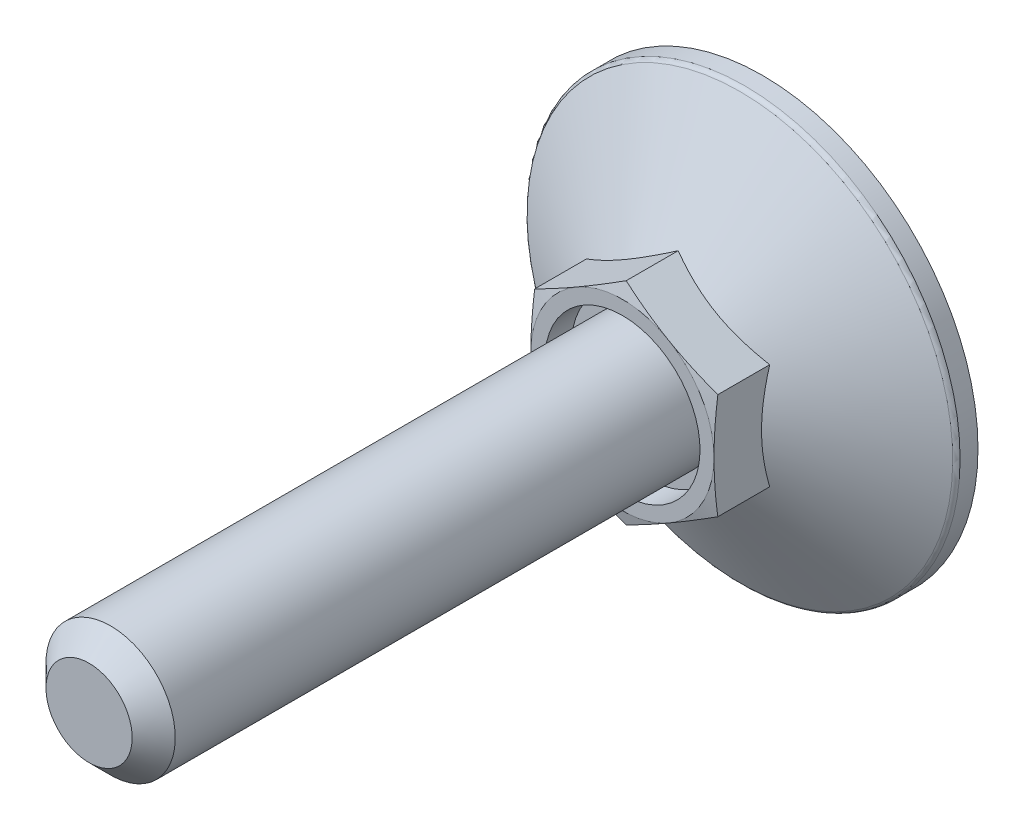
ISO-10303-21;
HEADER;
FILE_DESCRIPTION(('STEP AP214'),'2;1');
FILE_NAME('part.step','',(''),(''),'','','');
FILE_SCHEMA(('AUTOMOTIVE_DESIGN { 1 0 10303 214 1 1 1 1 }'));
ENDSEC;
DATA;
#1=APPLICATION_CONTEXT('core data for automotive mechanical design processes');
#2=APPLICATION_PROTOCOL_DEFINITION('international standard','automotive_design',2000,#1);
#3=PRODUCT_CONTEXT('',#1,'mechanical');
#4=PRODUCT('Part','Part','',(#3));
#5=PRODUCT_RELATED_PRODUCT_CATEGORY('part','',(#4));
#6=PRODUCT_DEFINITION_FORMATION('','',#4);
#7=PRODUCT_DEFINITION_CONTEXT('part definition',#1,'design');
#8=PRODUCT_DEFINITION('design','',#6,#7);
#9=PRODUCT_DEFINITION_SHAPE('','',#8);
#10=(LENGTH_UNIT() NAMED_UNIT(*) SI_UNIT(.MILLI.,.METRE.));
#11=(NAMED_UNIT(*) PLANE_ANGLE_UNIT() SI_UNIT($,.RADIAN.));
#12=(NAMED_UNIT(*) SI_UNIT($,.STERADIAN.) SOLID_ANGLE_UNIT());
#13=UNCERTAINTY_MEASURE_WITH_UNIT(LENGTH_MEASURE(1.E-05),#10,'distance_accuracy_value','');
#14=(GEOMETRIC_REPRESENTATION_CONTEXT(3) GLOBAL_UNCERTAINTY_ASSIGNED_CONTEXT((#13)) GLOBAL_UNIT_ASSIGNED_CONTEXT((#10,
#11,#12)) REPRESENTATION_CONTEXT('',''));
#15=CARTESIAN_POINT('',(0.,0.,0.));
#16=DIRECTION('',(0.,0.,1.));
#17=DIRECTION('',(1.,0.,0.));
#18=AXIS2_PLACEMENT_3D('',#15,#16,#17);
#19=CARTESIAN_POINT('',(0.,0.,10.525));
#20=DIRECTION('',(0.,0.,-1.));
#21=DIRECTION('',(0.,1.,0.));
#22=AXIS2_PLACEMENT_3D('',#19,#20,#21);
#23=PLANE('',#22);
#24=CARTESIAN_POINT('',(0.,0.,10.525));
#25=DIRECTION('',(0.,0.,-1.));
#26=DIRECTION('',(0.,1.,0.));
#27=AXIS2_PLACEMENT_3D('',#24,#25,#26);
#28=CIRCLE('',#27,7.2);
#29=CARTESIAN_POINT('',(0.,7.2,10.525));
#30=VERTEX_POINT('',#29);
#31=EDGE_CURVE('E108',#30,#30,#28,.T.);
#32=ORIENTED_EDGE('',*,*,#31,.F.);
#33=EDGE_LOOP('',(#32));
#34=FACE_BOUND('',#33,.T.);
#35=CARTESIAN_POINT('',(0.,0.,10.525));
#36=DIRECTION('',(0.,0.,-1.));
#37=DIRECTION('',(0.,1.,0.));
#38=AXIS2_PLACEMENT_3D('',#35,#36,#37);
#39=CIRCLE('',#38,6.);
#40=CARTESIAN_POINT('',(0.,6.,10.525));
#41=VERTEX_POINT('',#40);
#42=EDGE_CURVE('E260',#41,#41,#39,.F.);
#43=ORIENTED_EDGE('',*,*,#42,.F.);
#44=EDGE_LOOP('',(#43));
#45=FACE_BOUND('',#44,.T.);
#46=ADVANCED_FACE('F14',(#34,#45),#23,.F.);
#47=CARTESIAN_POINT('',(0.,9.81495457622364,99.));
#48=DIRECTION('',(0.5,-0.866025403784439,0.));
#49=DIRECTION('',(0.866025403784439,0.5,0.));
#50=AXIS2_PLACEMENT_3D('',#47,#48,#49);
#51=PLANE('',#50);
#52=CARTESIAN_POINT('',(-8.5002,4.90736181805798,7.83027204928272));
#53=CARTESIAN_POINT('',(-8.31336077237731,5.01523349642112,7.89254195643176));
#54=CARTESIAN_POINT('',(-8.1258249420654,5.1235073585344,7.95198579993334));
#55=CARTESIAN_POINT('',(-7.74923024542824,5.34093440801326,8.06444298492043));
#56=CARTESIAN_POINT('',(-7.56017075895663,5.45008795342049,8.1174535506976));
#57=CARTESIAN_POINT('',(-6.9899652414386,5.77929626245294,8.26579470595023));
#58=CARTESIAN_POINT('',(-6.60656835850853,6.00065055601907,8.3501691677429));
#59=CARTESIAN_POINT('',(-6.03282233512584,6.33190297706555,8.44910807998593));
#60=CARTESIAN_POINT('',(-5.84418723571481,6.44081150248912,8.47729289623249));
#61=CARTESIAN_POINT('',(-5.46606397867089,6.65912106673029,8.52455401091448));
#62=CARTESIAN_POINT('',(-5.27657589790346,6.76852206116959,8.54363111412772));
#63=CARTESIAN_POINT('',(-4.8972734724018,6.98751241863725,8.57219332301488));
#64=CARTESIAN_POINT('',(-4.7074597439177,7.09710142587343,8.58168931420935));
#65=CARTESIAN_POINT('',(-4.32765694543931,7.3163806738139,8.59088571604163));
#66=CARTESIAN_POINT('',(-4.13766788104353,7.42607091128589,8.59058642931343));
#67=CARTESIAN_POINT('',(-3.78247698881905,7.63114046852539,8.58087362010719));
#68=CARTESIAN_POINT('',(-3.6172500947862,7.72653426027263,8.57264492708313));
#69=CARTESIAN_POINT('',(-3.28718328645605,7.9170984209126,8.54893885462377));
#70=CARTESIAN_POINT('',(-3.12234339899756,8.01226877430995,8.53346098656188));
#71=CARTESIAN_POINT('',(-2.62846189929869,8.29741139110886,8.47651947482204));
#72=CARTESIAN_POINT('',(-2.30029449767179,8.48687892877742,8.42455503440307));
#73=CARTESIAN_POINT('',(-1.64047857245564,8.86782383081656,8.29464315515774));
#74=CARTESIAN_POINT('',(-1.30891425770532,9.05925257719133,8.21614502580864));
#75=CARTESIAN_POINT('',(-0.650730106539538,9.43925537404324,8.03798675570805));
#76=CARTESIAN_POINT('',(-0.324101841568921,9.62783429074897,7.93836845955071));
#77=CARTESIAN_POINT('',(0.000199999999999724,9.81507004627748,7.83027204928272));
#78=B_SPLINE_CURVE_WITH_KNOTS('',3,(#52,#53,#54,#55,#56,#57,#58,#59,#60,#61,#62,#63,#64,#65,#66,
#67,#68,#69,#70,#71,#72,#73,#74,#75,#76,#77),.UNSPECIFIED.,.F.,.F.,(4,2,2,2,2,2,2,2,2,2,2,2,4),
(0.,0.673596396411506,1.34748239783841,2.69805431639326,3.356799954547,4.01548737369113,
4.67342558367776,5.33134346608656,5.90409556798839,6.47688628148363,7.62328361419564,
8.79510569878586,9.9646274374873),.UNSPECIFIED.);
#79=CARTESIAN_POINT('',(-8.5,4.90747728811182,7.83033871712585));
#80=VERTEX_POINT('',#79);
#81=CARTESIAN_POINT('',(0.,9.81495457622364,7.83033871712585));
#82=VERTEX_POINT('',#81);
#83=EDGE_CURVE('E97',#80,#82,#78,.T.);
#84=ORIENTED_EDGE('',*,*,#83,.F.);
#85=DIRECTION('',(0.,0.,-1.));
#86=VECTOR('',#85,1.);
#87=CARTESIAN_POINT('',(-8.5,4.90747728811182,99.));
#88=LINE('',#87,#86);
#89=CARTESIAN_POINT('',(-8.5,4.90747728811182,12.6476589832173));
#90=VERTEX_POINT('',#89);
#91=EDGE_CURVE('E86',#90,#80,#88,.T.);
#92=ORIENTED_EDGE('',*,*,#91,.F.);
#93=CARTESIAN_POINT('',(0.000200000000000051,9.81507004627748,12.6476280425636));
#94=CARTESIAN_POINT('',(-0.352800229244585,9.61126526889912,12.7022599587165));
#95=CARTESIAN_POINT('',(-0.706440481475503,9.40709097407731,12.7518566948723));
#96=CARTESIAN_POINT('',(-1.41496987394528,8.99802133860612,12.8389934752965));
#97=CARTESIAN_POINT('',(-1.76985946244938,8.79312573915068,12.8765286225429));
#98=CARTESIAN_POINT('',(-2.47873586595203,8.38385575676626,12.9373509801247));
#99=CARTESIAN_POINT('',(-2.83271788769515,8.17948414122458,12.9607107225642));
#100=CARTESIAN_POINT('',(-3.5411333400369,7.77048028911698,12.9920337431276));
#101=CARTESIAN_POINT('',(-3.89556667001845,7.56584811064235,13.));
#102=CARTESIAN_POINT('',(-4.60443332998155,7.15658375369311,13.));
#103=CARTESIAN_POINT('',(-4.9588666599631,6.95195157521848,12.9920337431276));
#104=CARTESIAN_POINT('',(-5.66728211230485,6.54294772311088,12.9607107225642));
#105=CARTESIAN_POINT('',(-6.02126413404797,6.33857610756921,12.9373509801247));
#106=CARTESIAN_POINT('',(-6.73014053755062,5.92930612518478,12.8765286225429));
#107=CARTESIAN_POINT('',(-7.08503012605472,5.72441052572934,12.8389934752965));
#108=CARTESIAN_POINT('',(-7.7935595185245,5.31534089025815,12.7518566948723));
#109=CARTESIAN_POINT('',(-8.14719977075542,5.11116659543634,12.7022599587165));
#110=CARTESIAN_POINT('',(-8.5002,4.90736181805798,12.6476280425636));
#111=B_SPLINE_CURVE_WITH_KNOTS('',3,(#93,#94,#95,#96,#97,#98,#99,#100,#101,#102,#103,#104,#105,
#106,#107,#108,#109,#110),.UNSPECIFIED.,.F.,.F.,(4,2,2,2,2,2,2,2,4),(0.,1.23382789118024,
2.46815608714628,3.69611406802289,4.92383440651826,6.15155474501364,7.37951272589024,
8.61384092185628,9.84766881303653),.UNSPECIFIED.);
#112=CARTESIAN_POINT('',(-4.25,7.36121593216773,13.));
#113=VERTEX_POINT('',#112);
#114=EDGE_CURVE('E187',#113,#90,#111,.T.);
#115=ORIENTED_EDGE('',*,*,#114,.F.);
#116=CARTESIAN_POINT('',(0.,9.81495457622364,12.6476589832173));
#117=VERTEX_POINT('',#116);
#118=EDGE_CURVE('E319',#117,#113,#111,.T.);
#119=ORIENTED_EDGE('',*,*,#118,.F.);
#120=DIRECTION('',(0.,0.,-1.));
#121=VECTOR('',#120,1.);
#122=CARTESIAN_POINT('',(0.,9.81495457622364,99.));
#123=LINE('',#122,#121);
#124=EDGE_CURVE('E101',#117,#82,#123,.T.);
#125=ORIENTED_EDGE('',*,*,#124,.T.);
#126=EDGE_LOOP('',(#84,#92,#115,#119,#125));
#127=FACE_BOUND('',#126,.T.);
#128=ADVANCED_FACE('F100',(#127),#51,.F.);
#129=CARTESIAN_POINT('',(8.5,4.90747728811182,99.));
#130=DIRECTION('',(-0.5,-0.866025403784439,0.));
#131=DIRECTION('',(0.866025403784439,-0.5,0.));
#132=AXIS2_PLACEMENT_3D('',#129,#130,#131);
#133=PLANE('',#132);
#134=CARTESIAN_POINT('',(-0.0002,9.81507004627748,7.83027204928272));
#135=CARTESIAN_POINT('',(0.186639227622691,9.70719836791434,7.89254195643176));
#136=CARTESIAN_POINT('',(0.374175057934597,9.59892450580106,7.95198579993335));
#137=CARTESIAN_POINT('',(0.750769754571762,9.3814974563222,8.06444298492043));
#138=CARTESIAN_POINT('',(0.939829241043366,9.27234391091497,8.1174535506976));
#139=CARTESIAN_POINT('',(1.5100347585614,8.94313560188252,8.26579470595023));
#140=CARTESIAN_POINT('',(1.89343164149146,8.72178130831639,8.3501691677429));
#141=CARTESIAN_POINT('',(2.46717766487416,8.39052888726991,8.44910807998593));
#142=CARTESIAN_POINT('',(2.65581276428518,8.28162036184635,8.47729289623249));
#143=CARTESIAN_POINT('',(3.03393602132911,8.06331079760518,8.52455401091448));
#144=CARTESIAN_POINT('',(3.22342410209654,7.95390980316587,8.54363111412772));
#145=CARTESIAN_POINT('',(3.6027265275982,7.73491944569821,8.57219332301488));
#146=CARTESIAN_POINT('',(3.79254025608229,7.62533043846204,8.58168931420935));
#147=CARTESIAN_POINT('',(4.17234305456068,7.40605119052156,8.59088571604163));
#148=CARTESIAN_POINT('',(4.36233211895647,7.29636095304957,8.59058642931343));
#149=CARTESIAN_POINT('',(4.71752301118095,7.09129139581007,8.58087362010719));
#150=CARTESIAN_POINT('',(4.8827499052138,6.99589760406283,8.57264492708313));
#151=CARTESIAN_POINT('',(5.21281671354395,6.80533344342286,8.54893885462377));
#152=CARTESIAN_POINT('',(5.37765660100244,6.71016309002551,8.53346098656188));
#153=CARTESIAN_POINT('',(5.87153810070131,6.42502047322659,8.47651947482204));
#154=CARTESIAN_POINT('',(6.19970550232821,6.23555293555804,8.42455503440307));
#155=CARTESIAN_POINT('',(6.85952142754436,5.8546080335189,8.29464315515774));
#156=CARTESIAN_POINT('',(7.19108574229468,5.66317928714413,8.21614502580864));
#157=CARTESIAN_POINT('',(7.84926989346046,5.28317649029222,8.03798675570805));
#158=CARTESIAN_POINT('',(8.17589815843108,5.09459757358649,7.93836845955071));
#159=CARTESIAN_POINT('',(8.5002,4.90736181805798,7.83027204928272));
#160=B_SPLINE_CURVE_WITH_KNOTS('',3,(#134,#135,#136,#137,#138,#139,#140,#141,#142,#143,#144,
#145,#146,#147,#148,#149,#150,#151,#152,#153,#154,#155,#156,#157,#158,#159),.UNSPECIFIED.,.F.,
.F.,(4,2,2,2,2,2,2,2,2,2,2,2,4),(0.,0.673596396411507,1.34748239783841,2.69805431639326,
3.35679995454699,4.01548737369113,4.67342558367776,5.33134346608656,5.90409556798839,
6.47688628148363,7.62328361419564,8.79510569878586,9.9646274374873),.UNSPECIFIED.);
#161=CARTESIAN_POINT('',(8.5,4.90747728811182,7.83033871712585));
#162=VERTEX_POINT('',#161);
#163=EDGE_CURVE('E29',#82,#162,#160,.T.);
#164=ORIENTED_EDGE('',*,*,#163,.F.);
#165=ORIENTED_EDGE('',*,*,#124,.F.);
#166=CARTESIAN_POINT('',(8.5002,4.90736181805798,12.6476280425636));
#167=CARTESIAN_POINT('',(8.14719977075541,5.11116659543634,12.7022599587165));
#168=CARTESIAN_POINT('',(7.7935595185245,5.31534089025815,12.7518566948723));
#169=CARTESIAN_POINT('',(7.08503012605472,5.72441052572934,12.8389934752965));
#170=CARTESIAN_POINT('',(6.73014053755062,5.92930612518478,12.8765286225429));
#171=CARTESIAN_POINT('',(6.02126413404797,6.33857610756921,12.9373509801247));
#172=CARTESIAN_POINT('',(5.66728211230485,6.54294772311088,12.9607107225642));
#173=CARTESIAN_POINT('',(4.9588666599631,6.95195157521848,12.9920337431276));
#174=CARTESIAN_POINT('',(4.60443332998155,7.15658375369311,13.));
#175=CARTESIAN_POINT('',(3.89556667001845,7.56584811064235,13.));
#176=CARTESIAN_POINT('',(3.5411333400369,7.77048028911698,12.9920337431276));
#177=CARTESIAN_POINT('',(2.83271788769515,8.17948414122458,12.9607107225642));
#178=CARTESIAN_POINT('',(2.47873586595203,8.38385575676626,12.9373509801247));
#179=CARTESIAN_POINT('',(1.76985946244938,8.79312573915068,12.8765286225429));
#180=CARTESIAN_POINT('',(1.41496987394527,8.99802133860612,12.8389934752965));
#181=CARTESIAN_POINT('',(0.7064404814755,9.40709097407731,12.7518566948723));
#182=CARTESIAN_POINT('',(0.352800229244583,9.61126526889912,12.7022599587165));
#183=CARTESIAN_POINT('',(-0.000200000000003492,9.81507004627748,12.6476280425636));
#184=B_SPLINE_CURVE_WITH_KNOTS('',3,(#166,#167,#168,#169,#170,#171,#172,#173,#174,#175,#176,
#177,#178,#179,#180,#181,#182,#183),.UNSPECIFIED.,.F.,.F.,(4,2,2,2,2,2,2,2,4),(0.,
1.23382789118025,2.46815608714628,3.69611406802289,4.92383440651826,6.15155474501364,
7.37951272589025,8.61384092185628,9.84766881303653),.UNSPECIFIED.);
#185=CARTESIAN_POINT('',(4.25,7.36121593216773,13.));
#186=VERTEX_POINT('',#185);
#187=EDGE_CURVE('E178',#186,#117,#184,.T.);
#188=ORIENTED_EDGE('',*,*,#187,.F.);
#189=CARTESIAN_POINT('',(8.5,4.90747728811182,12.6476589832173));
#190=VERTEX_POINT('',#189);
#191=EDGE_CURVE('E185',#190,#186,#184,.T.);
#192=ORIENTED_EDGE('',*,*,#191,.F.);
#193=DIRECTION('',(0.,0.,-1.));
#194=VECTOR('',#193,1.);
#195=CARTESIAN_POINT('',(8.5,4.90747728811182,99.));
#196=LINE('',#195,#194);
#197=EDGE_CURVE('E217',#190,#162,#196,.T.);
#198=ORIENTED_EDGE('',*,*,#197,.T.);
#199=EDGE_LOOP('',(#164,#165,#188,#192,#198));
#200=FACE_BOUND('',#199,.T.);
#201=ADVANCED_FACE('F193',(#200),#133,.F.);
#202=CARTESIAN_POINT('',(8.5,-4.90747728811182,99.));
#203=DIRECTION('',(-1.,0.,0.));
#204=DIRECTION('',(0.,-1.,0.));
#205=AXIS2_PLACEMENT_3D('',#202,#203,#204);
#206=PLANE('',#205);
#207=CARTESIAN_POINT('',(8.5,12.8220542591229,4.61528116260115));
#208=CARTESIAN_POINT('',(8.5,12.4534155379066,4.79262377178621));
#209=CARTESIAN_POINT('',(8.5,12.0838902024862,4.96815716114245));
#210=CARTESIAN_POINT('',(8.5,11.3425927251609,5.31457894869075));
#211=CARTESIAN_POINT('',(8.5,10.9708202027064,5.48546653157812));
#212=CARTESIAN_POINT('',(8.5,10.2224625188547,5.82250763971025));
#213=CARTESIAN_POINT('',(8.5,9.84586188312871,5.98862693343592));
#214=CARTESIAN_POINT('',(8.5,9.08953299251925,6.31355867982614));
#215=CARTESIAN_POINT('',(8.5,8.70980489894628,6.47237150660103));
#216=CARTESIAN_POINT('',(8.5,7.93635853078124,6.78489169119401));
#217=CARTESIAN_POINT('',(8.5,7.5425381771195,6.93834789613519));
#218=CARTESIAN_POINT('',(8.5,6.75016193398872,7.23275009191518));
#219=CARTESIAN_POINT('',(8.5,6.35160550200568,7.37369463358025));
#220=CARTESIAN_POINT('',(8.5,5.54998630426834,7.63911020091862));
#221=CARTESIAN_POINT('',(8.5,5.14693580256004,7.76361784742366));
#222=CARTESIAN_POINT('',(8.5,4.33508769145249,7.99193558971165));
#223=CARTESIAN_POINT('',(8.5,3.92629204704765,8.09575258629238));
#224=CARTESIAN_POINT('',(8.5,3.10458766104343,8.27700176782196));
#225=CARTESIAN_POINT('',(8.5,2.69170444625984,8.35454642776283));
#226=CARTESIAN_POINT('',(8.5,2.06892742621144,8.44757828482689));
#227=CARTESIAN_POINT('',(8.5,1.86074253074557,8.47470931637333));
#228=CARTESIAN_POINT('',(8.5,1.44346514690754,8.52067173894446));
#229=CARTESIAN_POINT('',(8.5,1.23437274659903,8.5395039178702));
#230=CARTESIAN_POINT('',(8.5,0.818123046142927,8.5682751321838));
#231=CARTESIAN_POINT('',(8.5,0.6109730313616,8.57831925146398));
#232=CARTESIAN_POINT('',(8.5,0.196434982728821,8.58967320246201));
#233=CARTESIAN_POINT('',(8.5,-0.0109530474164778,8.59098316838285));
#234=CARTESIAN_POINT('',(8.5,-0.425608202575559,8.58483724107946));
#235=CARTESIAN_POINT('',(8.5,-0.632875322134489,8.57738097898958));
#236=CARTESIAN_POINT('',(8.5,-1.04692490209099,8.55387613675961));
#237=CARTESIAN_POINT('',(8.5,-1.25370733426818,8.5378270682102));
#238=CARTESIAN_POINT('',(8.5,-1.76172684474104,8.48816674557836));
#239=CARTESIAN_POINT('',(8.5,-2.06251418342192,8.44986872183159));
#240=CARTESIAN_POINT('',(8.5,-2.66160170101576,8.35726697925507));
#241=CARTESIAN_POINT('',(8.5,-2.95990148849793,8.30296078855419));
#242=CARTESIAN_POINT('',(8.5,-3.85084347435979,8.11893322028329));
#243=CARTESIAN_POINT('',(8.5,-4.4391769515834,7.96814146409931));
#244=CARTESIAN_POINT('',(8.5,-5.31919968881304,7.70971639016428));
#245=CARTESIAN_POINT('',(8.5,-5.61551051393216,7.61694416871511));
#246=CARTESIAN_POINT('',(8.5,-6.20524874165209,7.4225646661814));
#247=CARTESIAN_POINT('',(8.5,-6.4986761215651,7.3209573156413));
#248=CARTESIAN_POINT('',(8.5,-7.08276471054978,7.11046965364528));
#249=CARTESIAN_POINT('',(8.5,-7.37342689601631,7.0015920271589));
#250=CARTESIAN_POINT('',(8.5,-7.95239195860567,6.77777126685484));
#251=CARTESIAN_POINT('',(8.5,-8.2406948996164,6.66282829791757));
#252=CARTESIAN_POINT('',(8.5,-8.80562449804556,6.43181846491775));
#253=CARTESIAN_POINT('',(8.5,-9.08231928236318,6.31591764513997));
#254=CARTESIAN_POINT('',(8.5,-9.63401072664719,6.0801365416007));
#255=CARTESIAN_POINT('',(8.5,-9.90900735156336,5.96025617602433));
#256=CARTESIAN_POINT('',(8.5,-10.7318217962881,5.59557173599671));
#257=CARTESIAN_POINT('',(8.5,-11.2774137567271,5.34574521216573));
#258=CARTESIAN_POINT('',(8.5,-12.3642460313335,4.83628492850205));
#259=CARTESIAN_POINT('',(8.5,-12.905484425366,4.57664710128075));
#260=CARTESIAN_POINT('',(8.5,-13.9843891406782,4.05013469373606));
#261=CARTESIAN_POINT('',(8.5,-14.5220556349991,3.78326046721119));
#262=CARTESIAN_POINT('',(8.5,-15.5954930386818,3.24355438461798));
#263=CARTESIAN_POINT('',(8.5,-16.1312593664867,2.97071343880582));
#264=CARTESIAN_POINT('',(8.5,-17.2005865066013,2.4207361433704));
#265=CARTESIAN_POINT('',(8.5,-17.7341472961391,2.14359974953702));
#266=CARTESIAN_POINT('',(8.5,-18.7993643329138,1.58600707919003));
#267=CARTESIAN_POINT('',(8.5,-19.3310210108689,1.30555162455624));
#268=CARTESIAN_POINT('',(8.5,-20.3928917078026,0.741921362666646));
#269=CARTESIAN_POINT('',(8.5,-20.9231057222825,0.458746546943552));
#270=CARTESIAN_POINT('',(8.5,-22.3874236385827,-0.32722037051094));
#271=CARTESIAN_POINT('',(8.5,-23.3202800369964,-0.83233607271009));
#272=CARTESIAN_POINT('',(8.5,-25.1833983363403,-1.84747335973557));
#273=CARTESIAN_POINT('',(8.5,-26.1136600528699,-2.35749528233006));
#274=CARTESIAN_POINT('',(8.5,-27.9692131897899,-3.37950461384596));
#275=CARTESIAN_POINT('',(8.5,-28.8945109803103,-3.89148046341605));
#276=CARTESIAN_POINT('',(8.5,-30.2812847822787,-4.66146611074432));
#277=CARTESIAN_POINT('',(8.5,-30.7433285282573,-4.91845451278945));
#278=CARTESIAN_POINT('',(8.5,-31.6670795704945,-5.43303439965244));
#279=CARTESIAN_POINT('',(8.5,-32.1287868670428,-5.69062588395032));
#280=CARTESIAN_POINT('',(8.5,-32.5903473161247,-5.94848028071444));
#281=B_SPLINE_CURVE_WITH_KNOTS('',3,(#207,#208,#209,#210,#211,#212,#213,#214,#215,#216,#217,
#218,#219,#220,#221,#222,#223,#224,#225,#226,#227,#228,#229,#230,#231,#232,#233,#234,#235,#236,
#237,#238,#239,#240,#241,#242,#243,#244,#245,#246,#247,#248,#249,#250,#251,#252,#253,#254,#255,
#256,#257,#258,#259,#260,#261,#262,#263,#264,#265,#266,#267,#268,#269,#270,#271,#272,#273,#274,
#275,#276,#277,#278,#279,#280),.UNSPECIFIED.,.F.,.F.,(4,2,2,2,2,2,2,2,2,2,2,2,2,2,2,2,2,2,2,2,2,
2,2,2,2,2,2,2,2,2,2,2,2,2,2,2,4),(0.,1.22725127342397,2.45471654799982,3.68948778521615,
4.92419572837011,6.19201746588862,7.45998585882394,8.72507978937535,9.98975107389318,
11.2489376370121,11.878634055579,12.5082706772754,13.1302712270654,13.7522622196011,
14.3742793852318,14.9963319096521,15.9054589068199,16.814726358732,18.6343169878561,
19.5657329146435,20.4971561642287,21.4282373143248,22.3592931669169,23.259222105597,
24.1591695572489,25.9592281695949,27.7600413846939,29.5607667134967,31.3644583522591,
33.1681685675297,34.9714411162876,36.7747192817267,39.9571898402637,43.1398810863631,
46.3123590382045,47.8984694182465,49.4845784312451),.UNSPECIFIED.);
#282=CARTESIAN_POINT('',(8.5,-4.90747728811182,7.83033871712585));
#283=VERTEX_POINT('',#282);
#284=EDGE_CURVE('E37',#162,#283,#281,.T.);
#285=ORIENTED_EDGE('',*,*,#284,.F.);
#286=ORIENTED_EDGE('',*,*,#197,.F.);
#287=CARTESIAN_POINT('',(8.5,12.9820891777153,11.1197370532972));
#288=CARTESIAN_POINT('',(8.5,12.5964686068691,11.2061594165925));
#289=CARTESIAN_POINT('',(8.5,12.2106068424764,11.2915248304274));
#290=CARTESIAN_POINT('',(8.5,11.4382824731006,11.4595712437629));
#291=CARTESIAN_POINT('',(8.5,11.0518198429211,11.5422521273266));
#292=CARTESIAN_POINT('',(8.5,10.2778290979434,11.7044309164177));
#293=CARTESIAN_POINT('',(8.5,9.89030030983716,11.7839256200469));
#294=CARTESIAN_POINT('',(8.5,9.11443612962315,11.9388739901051));
#295=CARTESIAN_POINT('',(8.5,8.72610074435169,12.0143276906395));
#296=CARTESIAN_POINT('',(8.5,7.95158013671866,12.159650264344));
#297=CARTESIAN_POINT('',(8.5,7.56540239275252,12.2295587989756));
#298=CARTESIAN_POINT('',(8.5,6.79199352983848,12.3632725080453));
#299=CARTESIAN_POINT('',(8.5,6.40476243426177,12.4270778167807));
#300=CARTESIAN_POINT('',(8.5,5.62917169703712,12.54714843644));
#301=CARTESIAN_POINT('',(8.5,5.24081220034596,12.6034146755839));
#302=CARTESIAN_POINT('',(8.5,4.46285737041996,12.70674908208));
#303=CARTESIAN_POINT('',(8.5,4.07326203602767,12.7538172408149));
#304=CARTESIAN_POINT('',(8.5,3.28844017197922,12.8374226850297));
#305=CARTESIAN_POINT('',(8.5,2.89320002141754,12.8738340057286));
#306=CARTESIAN_POINT('',(8.5,2.10172608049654,12.9336139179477));
#307=CARTESIAN_POINT('',(8.5,1.70549231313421,12.9569828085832));
#308=CARTESIAN_POINT('',(8.5,0.912605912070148,12.9893148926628));
#309=CARTESIAN_POINT('',(8.5,0.515953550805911,12.9982846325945));
#310=CARTESIAN_POINT('',(8.5,-0.27740821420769,13.0012669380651));
#311=CARTESIAN_POINT('',(8.5,-0.674117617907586,12.9952795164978));
#312=CARTESIAN_POINT('',(8.5,-1.46847963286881,12.9686842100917));
#313=CARTESIAN_POINT('',(8.5,-1.86613043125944,12.9480232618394));
#314=CARTESIAN_POINT('',(8.5,-2.66049684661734,12.8932602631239));
#315=CARTESIAN_POINT('',(8.5,-3.05721244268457,12.8591579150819));
#316=CARTESIAN_POINT('',(8.5,-3.84970511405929,12.7792347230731));
#317=CARTESIAN_POINT('',(8.5,-4.24548140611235,12.7334062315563));
#318=CARTESIAN_POINT('',(8.5,-5.03576028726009,12.6319377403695));
#319=CARTESIAN_POINT('',(8.5,-5.43026287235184,12.5762977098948));
#320=CARTESIAN_POINT('',(8.5,-6.19195385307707,12.4609360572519));
#321=CARTESIAN_POINT('',(8.5,-6.55922094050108,12.4017287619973));
#322=CARTESIAN_POINT('',(8.5,-7.29278719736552,12.2775674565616));
#323=CARTESIAN_POINT('',(8.5,-7.65908634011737,12.2126132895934));
#324=CARTESIAN_POINT('',(8.5,-8.39085027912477,12.078008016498));
#325=CARTESIAN_POINT('',(8.5,-8.75631499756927,12.0083564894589));
#326=CARTESIAN_POINT('',(8.5,-9.48649515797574,11.8652200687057));
#327=CARTESIAN_POINT('',(8.5,-9.85121059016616,11.7917351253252));
#328=CARTESIAN_POINT('',(8.5,-10.5800753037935,11.6416087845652));
#329=CARTESIAN_POINT('',(8.5,-10.944224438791,11.5649666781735));
#330=CARTESIAN_POINT('',(8.5,-11.6719684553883,11.4090909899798));
#331=CARTESIAN_POINT('',(8.5,-12.0355633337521,11.3298573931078));
#332=CARTESIAN_POINT('',(8.5,-13.1255915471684,11.0889686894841));
#333=CARTESIAN_POINT('',(8.5,-13.8513178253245,10.9241153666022));
#334=CARTESIAN_POINT('',(8.5,-15.2942598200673,10.590109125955));
#335=CARTESIAN_POINT('',(8.5,-16.0114890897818,10.421014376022));
#336=CARTESIAN_POINT('',(8.5,-17.4449475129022,10.0785875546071));
#337=CARTESIAN_POINT('',(8.5,-18.1611766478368,9.9052554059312));
#338=CARTESIAN_POINT('',(8.5,-19.5919856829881,9.55567998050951));
#339=CARTESIAN_POINT('',(8.5,-20.306566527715,9.37944056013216));
#340=CARTESIAN_POINT('',(8.5,-21.7351057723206,9.02455520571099));
#341=CARTESIAN_POINT('',(8.5,-22.4490641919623,8.84590935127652));
#342=CARTESIAN_POINT('',(8.5,-23.1628057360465,8.66641079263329));
#343=B_SPLINE_CURVE_WITH_KNOTS('',3,(#287,#288,#289,#290,#291,#292,#293,#294,#295,#296,#297,
#298,#299,#300,#301,#302,#303,#304,#305,#306,#307,#308,#309,#310,#311,#312,#313,#314,#315,#316,
#317,#318,#319,#320,#321,#322,#323,#324,#325,#326,#327,#328,#329,#330,#331,#332,#333,#334,#335,
#336,#337,#338,#339,#340,#341,#342),.UNSPECIFIED.,.F.,.F.,(4,2,2,2,2,2,2,2,2,2,2,2,2,2,2,2,2,2,
2,2,2,2,2,2,2,2,2,4),(0.,1.18556310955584,2.37117735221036,3.5579546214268,4.74472187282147,
5.92204594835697,7.09934411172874,8.27649719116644,9.45365137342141,10.6442044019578,
11.8347301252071,13.0247144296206,14.2146977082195,15.4090063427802,16.6033414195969,
17.7984574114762,18.9935771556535,20.1095500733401,21.2255534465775,22.3416569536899,
23.4577749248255,24.5741449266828,25.6905214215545,27.9231231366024,30.1337863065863,
32.3444897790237,34.5524651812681,36.7603677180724),.UNSPECIFIED.);
#344=CARTESIAN_POINT('',(8.5,0.,13.));
#345=VERTEX_POINT('',#344);
#346=EDGE_CURVE('E171',#345,#190,#343,.F.);
#347=ORIENTED_EDGE('',*,*,#346,.F.);
#348=CARTESIAN_POINT('',(8.5,-4.90747728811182,12.6476589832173));
#349=VERTEX_POINT('',#348);
#350=EDGE_CURVE('E186',#349,#345,#343,.F.);
#351=ORIENTED_EDGE('',*,*,#350,.F.);
#352=DIRECTION('',(0.,0.,-1.));
#353=VECTOR('',#352,1.);
#354=CARTESIAN_POINT('',(8.5,-4.90747728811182,99.));
#355=LINE('',#354,#353);
#356=EDGE_CURVE('E219',#349,#283,#355,.T.);
#357=ORIENTED_EDGE('',*,*,#356,.T.);
#358=EDGE_LOOP('',(#285,#286,#347,#351,#357));
#359=FACE_BOUND('',#358,.T.);
#360=ADVANCED_FACE('F196',(#359),#206,.F.);
#361=CARTESIAN_POINT('',(0.,-9.81495457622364,99.));
#362=DIRECTION('',(-0.5,0.866025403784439,0.));
#363=DIRECTION('',(-0.866025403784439,-0.5,0.));
#364=AXIS2_PLACEMENT_3D('',#361,#362,#363);
#365=PLANE('',#364);
#366=CARTESIAN_POINT('',(8.5002,-4.90736181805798,7.83027204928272));
#367=CARTESIAN_POINT('',(8.31336077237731,-5.01523349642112,7.89254195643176));
#368=CARTESIAN_POINT('',(8.1258249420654,-5.1235073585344,7.95198579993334));
#369=CARTESIAN_POINT('',(7.74923024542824,-5.34093440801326,8.06444298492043));
#370=CARTESIAN_POINT('',(7.56017075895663,-5.45008795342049,8.1174535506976));
#371=CARTESIAN_POINT('',(6.9899652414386,-5.77929626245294,8.26579470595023));
#372=CARTESIAN_POINT('',(6.60656835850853,-6.00065055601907,8.3501691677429));
#373=CARTESIAN_POINT('',(6.03282233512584,-6.33190297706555,8.44910807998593));
#374=CARTESIAN_POINT('',(5.84418723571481,-6.44081150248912,8.47729289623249));
#375=CARTESIAN_POINT('',(5.46606397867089,-6.65912106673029,8.52455401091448));
#376=CARTESIAN_POINT('',(5.27657589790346,-6.76852206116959,8.54363111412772));
#377=CARTESIAN_POINT('',(4.8972734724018,-6.98751241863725,8.57219332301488));
#378=CARTESIAN_POINT('',(4.7074597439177,-7.09710142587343,8.58168931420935));
#379=CARTESIAN_POINT('',(4.32765694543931,-7.3163806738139,8.59088571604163));
#380=CARTESIAN_POINT('',(4.13766788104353,-7.42607091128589,8.59058642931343));
#381=CARTESIAN_POINT('',(3.78247698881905,-7.63114046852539,8.58087362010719));
#382=CARTESIAN_POINT('',(3.6172500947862,-7.72653426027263,8.57264492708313));
#383=CARTESIAN_POINT('',(3.28718328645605,-7.9170984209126,8.54893885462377));
#384=CARTESIAN_POINT('',(3.12234339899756,-8.01226877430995,8.53346098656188));
#385=CARTESIAN_POINT('',(2.62846189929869,-8.29741139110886,8.47651947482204));
#386=CARTESIAN_POINT('',(2.30029449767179,-8.48687892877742,8.42455503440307));
#387=CARTESIAN_POINT('',(1.64047857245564,-8.86782383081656,8.29464315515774));
#388=CARTESIAN_POINT('',(1.30891425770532,-9.05925257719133,8.21614502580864));
#389=CARTESIAN_POINT('',(0.650730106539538,-9.43925537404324,8.03798675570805));
#390=CARTESIAN_POINT('',(0.324101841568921,-9.62783429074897,7.93836845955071));
#391=CARTESIAN_POINT('',(-0.000199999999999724,-9.81507004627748,7.83027204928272));
#392=B_SPLINE_CURVE_WITH_KNOTS('',3,(#366,#367,#368,#369,#370,#371,#372,#373,#374,#375,#376,
#377,#378,#379,#380,#381,#382,#383,#384,#385,#386,#387,#388,#389,#390,#391),.UNSPECIFIED.,.F.,
.F.,(4,2,2,2,2,2,2,2,2,2,2,2,4),(0.,0.673596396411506,1.34748239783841,2.69805431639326,
3.356799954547,4.01548737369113,4.67342558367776,5.33134346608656,5.90409556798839,
6.47688628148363,7.62328361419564,8.79510569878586,9.9646274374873),.UNSPECIFIED.);
#393=CARTESIAN_POINT('',(0.,-9.81495457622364,7.83033871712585));
#394=VERTEX_POINT('',#393);
#395=EDGE_CURVE('E277',#283,#394,#392,.T.);
#396=ORIENTED_EDGE('',*,*,#395,.F.);
#397=ORIENTED_EDGE('',*,*,#356,.F.);
#398=CARTESIAN_POINT('',(-0.000200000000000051,-9.81507004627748,12.6476280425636));
#399=CARTESIAN_POINT('',(0.352800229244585,-9.61126526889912,12.7022599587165));
#400=CARTESIAN_POINT('',(0.706440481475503,-9.40709097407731,12.7518566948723));
#401=CARTESIAN_POINT('',(1.41496987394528,-8.99802133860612,12.8389934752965));
#402=CARTESIAN_POINT('',(1.76985946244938,-8.79312573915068,12.8765286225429));
#403=CARTESIAN_POINT('',(2.47873586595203,-8.38385575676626,12.9373509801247));
#404=CARTESIAN_POINT('',(2.83271788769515,-8.17948414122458,12.9607107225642));
#405=CARTESIAN_POINT('',(3.5411333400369,-7.77048028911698,12.9920337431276));
#406=CARTESIAN_POINT('',(3.89556667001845,-7.56584811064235,13.));
#407=CARTESIAN_POINT('',(4.60443332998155,-7.15658375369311,13.));
#408=CARTESIAN_POINT('',(4.9588666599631,-6.95195157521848,12.9920337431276));
#409=CARTESIAN_POINT('',(5.66728211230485,-6.54294772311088,12.9607107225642));
#410=CARTESIAN_POINT('',(6.02126413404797,-6.33857610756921,12.9373509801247));
#411=CARTESIAN_POINT('',(6.73014053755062,-5.92930612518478,12.8765286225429));
#412=CARTESIAN_POINT('',(7.08503012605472,-5.72441052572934,12.8389934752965));
#413=CARTESIAN_POINT('',(7.7935595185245,-5.31534089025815,12.7518566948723));
#414=CARTESIAN_POINT('',(8.14719977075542,-5.11116659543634,12.7022599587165));
#415=CARTESIAN_POINT('',(8.5002,-4.90736181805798,12.6476280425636));
#416=B_SPLINE_CURVE_WITH_KNOTS('',3,(#398,#399,#400,#401,#402,#403,#404,#405,#406,#407,#408,
#409,#410,#411,#412,#413,#414,#415),.UNSPECIFIED.,.F.,.F.,(4,2,2,2,2,2,2,2,4),(0.,
1.23382789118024,2.46815608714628,3.69611406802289,4.92383440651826,6.15155474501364,
7.37951272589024,8.61384092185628,9.84766881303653),.UNSPECIFIED.);
#417=CARTESIAN_POINT('',(4.25,-7.36121593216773,13.));
#418=VERTEX_POINT('',#417);
#419=EDGE_CURVE('E165',#418,#349,#416,.T.);
#420=ORIENTED_EDGE('',*,*,#419,.F.);
#421=CARTESIAN_POINT('',(0.,-9.81495457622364,12.6476589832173));
#422=VERTEX_POINT('',#421);
#423=EDGE_CURVE('E300',#422,#418,#416,.T.);
#424=ORIENTED_EDGE('',*,*,#423,.F.);
#425=DIRECTION('',(0.,0.,-1.));
#426=VECTOR('',#425,1.);
#427=CARTESIAN_POINT('',(0.,-9.81495457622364,99.));
#428=LINE('',#427,#426);
#429=EDGE_CURVE('E221',#422,#394,#428,.T.);
#430=ORIENTED_EDGE('',*,*,#429,.T.);
#431=EDGE_LOOP('',(#396,#397,#420,#424,#430));
#432=FACE_BOUND('',#431,.T.);
#433=ADVANCED_FACE('F282',(#432),#365,.F.);
#434=CARTESIAN_POINT('',(-8.5,-4.90747728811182,99.));
#435=DIRECTION('',(0.5,0.866025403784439,0.));
#436=DIRECTION('',(-0.866025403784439,0.5,0.));
#437=AXIS2_PLACEMENT_3D('',#434,#435,#436);
#438=PLANE('',#437);
#439=CARTESIAN_POINT('',(0.0002,-9.81507004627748,7.83027204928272));
#440=CARTESIAN_POINT('',(-0.186639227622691,-9.70719836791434,7.89254195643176));
#441=CARTESIAN_POINT('',(-0.374175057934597,-9.59892450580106,7.95198579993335));
#442=CARTESIAN_POINT('',(-0.750769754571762,-9.3814974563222,8.06444298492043));
#443=CARTESIAN_POINT('',(-0.939829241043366,-9.27234391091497,8.1174535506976));
#444=CARTESIAN_POINT('',(-1.5100347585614,-8.94313560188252,8.26579470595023));
#445=CARTESIAN_POINT('',(-1.89343164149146,-8.72178130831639,8.3501691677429));
#446=CARTESIAN_POINT('',(-2.46717766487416,-8.39052888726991,8.44910807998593));
#447=CARTESIAN_POINT('',(-2.65581276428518,-8.28162036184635,8.47729289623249));
#448=CARTESIAN_POINT('',(-3.03393602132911,-8.06331079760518,8.52455401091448));
#449=CARTESIAN_POINT('',(-3.22342410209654,-7.95390980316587,8.54363111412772));
#450=CARTESIAN_POINT('',(-3.6027265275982,-7.73491944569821,8.57219332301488));
#451=CARTESIAN_POINT('',(-3.79254025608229,-7.62533043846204,8.58168931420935));
#452=CARTESIAN_POINT('',(-4.17234305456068,-7.40605119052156,8.59088571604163));
#453=CARTESIAN_POINT('',(-4.36233211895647,-7.29636095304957,8.59058642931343));
#454=CARTESIAN_POINT('',(-4.71752301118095,-7.09129139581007,8.58087362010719));
#455=CARTESIAN_POINT('',(-4.8827499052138,-6.99589760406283,8.57264492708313));
#456=CARTESIAN_POINT('',(-5.21281671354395,-6.80533344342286,8.54893885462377));
#457=CARTESIAN_POINT('',(-5.37765660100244,-6.71016309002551,8.53346098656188));
#458=CARTESIAN_POINT('',(-5.87153810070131,-6.42502047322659,8.47651947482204));
#459=CARTESIAN_POINT('',(-6.19970550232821,-6.23555293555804,8.42455503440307));
#460=CARTESIAN_POINT('',(-6.85952142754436,-5.8546080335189,8.29464315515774));
#461=CARTESIAN_POINT('',(-7.19108574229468,-5.66317928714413,8.21614502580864));
#462=CARTESIAN_POINT('',(-7.84926989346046,-5.28317649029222,8.03798675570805));
#463=CARTESIAN_POINT('',(-8.17589815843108,-5.09459757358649,7.93836845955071));
#464=CARTESIAN_POINT('',(-8.5002,-4.90736181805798,7.83027204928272));
#465=B_SPLINE_CURVE_WITH_KNOTS('',3,(#439,#440,#441,#442,#443,#444,#445,#446,#447,#448,#449,
#450,#451,#452,#453,#454,#455,#456,#457,#458,#459,#460,#461,#462,#463,#464),.UNSPECIFIED.,.F.,
.F.,(4,2,2,2,2,2,2,2,2,2,2,2,4),(0.,0.673596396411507,1.34748239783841,2.69805431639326,
3.35679995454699,4.01548737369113,4.67342558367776,5.33134346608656,5.90409556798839,
6.47688628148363,7.62328361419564,8.79510569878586,9.9646274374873),.UNSPECIFIED.);
#466=CARTESIAN_POINT('',(-8.5,-4.90747728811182,7.83033871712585));
#467=VERTEX_POINT('',#466);
#468=EDGE_CURVE('E107',#394,#467,#465,.T.);
#469=ORIENTED_EDGE('',*,*,#468,.F.);
#470=ORIENTED_EDGE('',*,*,#429,.F.);
#471=CARTESIAN_POINT('',(-8.5002,-4.90736181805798,12.6476280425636));
#472=CARTESIAN_POINT('',(-8.14719977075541,-5.11116659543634,12.7022599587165));
#473=CARTESIAN_POINT('',(-7.7935595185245,-5.31534089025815,12.7518566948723));
#474=CARTESIAN_POINT('',(-7.08503012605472,-5.72441052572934,12.8389934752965));
#475=CARTESIAN_POINT('',(-6.73014053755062,-5.92930612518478,12.8765286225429));
#476=CARTESIAN_POINT('',(-6.02126413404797,-6.33857610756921,12.9373509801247));
#477=CARTESIAN_POINT('',(-5.66728211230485,-6.54294772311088,12.9607107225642));
#478=CARTESIAN_POINT('',(-4.9588666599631,-6.95195157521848,12.9920337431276));
#479=CARTESIAN_POINT('',(-4.60443332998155,-7.15658375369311,13.));
#480=CARTESIAN_POINT('',(-3.89556667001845,-7.56584811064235,13.));
#481=CARTESIAN_POINT('',(-3.5411333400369,-7.77048028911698,12.9920337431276));
#482=CARTESIAN_POINT('',(-2.83271788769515,-8.17948414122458,12.9607107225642));
#483=CARTESIAN_POINT('',(-2.47873586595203,-8.38385575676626,12.9373509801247));
#484=CARTESIAN_POINT('',(-1.76985946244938,-8.79312573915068,12.8765286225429));
#485=CARTESIAN_POINT('',(-1.41496987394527,-8.99802133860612,12.8389934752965));
#486=CARTESIAN_POINT('',(-0.7064404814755,-9.40709097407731,12.7518566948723));
#487=CARTESIAN_POINT('',(-0.352800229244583,-9.61126526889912,12.7022599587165));
#488=CARTESIAN_POINT('',(0.000200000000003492,-9.81507004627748,12.6476280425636));
#489=B_SPLINE_CURVE_WITH_KNOTS('',3,(#471,#472,#473,#474,#475,#476,#477,#478,#479,#480,#481,
#482,#483,#484,#485,#486,#487,#488),.UNSPECIFIED.,.F.,.F.,(4,2,2,2,2,2,2,2,4),(0.,
1.23382789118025,2.46815608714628,3.69611406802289,4.92383440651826,6.15155474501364,
7.37951272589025,8.61384092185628,9.84766881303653),.UNSPECIFIED.);
#490=CARTESIAN_POINT('',(-4.25,-7.36121593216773,13.));
#491=VERTEX_POINT('',#490);
#492=EDGE_CURVE('E144',#491,#422,#489,.T.);
#493=ORIENTED_EDGE('',*,*,#492,.F.);
#494=CARTESIAN_POINT('',(-8.5,-4.90747728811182,12.6476589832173));
#495=VERTEX_POINT('',#494);
#496=EDGE_CURVE('E227',#495,#491,#489,.T.);
#497=ORIENTED_EDGE('',*,*,#496,.F.);
#498=DIRECTION('',(0.,0.,-1.));
#499=VECTOR('',#498,1.);
#500=CARTESIAN_POINT('',(-8.5,-4.90747728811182,99.));
#501=LINE('',#500,#499);
#502=EDGE_CURVE('E96',#495,#467,#501,.T.);
#503=ORIENTED_EDGE('',*,*,#502,.T.);
#504=EDGE_LOOP('',(#469,#470,#493,#497,#503));
#505=FACE_BOUND('',#504,.T.);
#506=ADVANCED_FACE('F129',(#505),#438,.F.);
#507=CARTESIAN_POINT('',(-8.5,4.90747728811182,99.));
#508=DIRECTION('',(1.,0.,0.));
#509=DIRECTION('',(0.,1.,0.));
#510=AXIS2_PLACEMENT_3D('',#507,#508,#509);
#511=PLANE('',#510);
#512=CARTESIAN_POINT('',(-8.5,12.8220542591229,4.61528116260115));
#513=CARTESIAN_POINT('',(-8.5,12.4534155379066,4.79262377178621));
#514=CARTESIAN_POINT('',(-8.5,12.0838902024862,4.96815716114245));
#515=CARTESIAN_POINT('',(-8.5,11.3425927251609,5.31457894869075));
#516=CARTESIAN_POINT('',(-8.5,10.9708202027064,5.48546653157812));
#517=CARTESIAN_POINT('',(-8.5,10.2224625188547,5.82250763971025));
#518=CARTESIAN_POINT('',(-8.5,9.84586188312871,5.98862693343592));
#519=CARTESIAN_POINT('',(-8.5,9.08953299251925,6.31355867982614));
#520=CARTESIAN_POINT('',(-8.5,8.70980489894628,6.47237150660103));
#521=CARTESIAN_POINT('',(-8.5,7.93635853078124,6.78489169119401));
#522=CARTESIAN_POINT('',(-8.5,7.5425381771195,6.93834789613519));
#523=CARTESIAN_POINT('',(-8.5,6.75016193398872,7.23275009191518));
#524=CARTESIAN_POINT('',(-8.5,6.35160550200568,7.37369463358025));
#525=CARTESIAN_POINT('',(-8.5,5.54998630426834,7.63911020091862));
#526=CARTESIAN_POINT('',(-8.5,5.14693580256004,7.76361784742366));
#527=CARTESIAN_POINT('',(-8.5,4.33508769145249,7.99193558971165));
#528=CARTESIAN_POINT('',(-8.5,3.92629204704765,8.09575258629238));
#529=CARTESIAN_POINT('',(-8.5,3.10458766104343,8.27700176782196));
#530=CARTESIAN_POINT('',(-8.5,2.69170444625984,8.35454642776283));
#531=CARTESIAN_POINT('',(-8.5,2.06892742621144,8.44757828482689));
#532=CARTESIAN_POINT('',(-8.5,1.86074253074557,8.47470931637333));
#533=CARTESIAN_POINT('',(-8.5,1.44346514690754,8.52067173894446));
#534=CARTESIAN_POINT('',(-8.5,1.23437274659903,8.5395039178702));
#535=CARTESIAN_POINT('',(-8.5,0.818123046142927,8.5682751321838));
#536=CARTESIAN_POINT('',(-8.5,0.6109730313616,8.57831925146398));
#537=CARTESIAN_POINT('',(-8.5,0.196434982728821,8.58967320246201));
#538=CARTESIAN_POINT('',(-8.5,-0.0109530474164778,8.59098316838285));
#539=CARTESIAN_POINT('',(-8.5,-0.425608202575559,8.58483724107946));
#540=CARTESIAN_POINT('',(-8.5,-0.632875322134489,8.57738097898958));
#541=CARTESIAN_POINT('',(-8.5,-1.04692490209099,8.55387613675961));
#542=CARTESIAN_POINT('',(-8.5,-1.25370733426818,8.5378270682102));
#543=CARTESIAN_POINT('',(-8.5,-1.76172684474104,8.48816674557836));
#544=CARTESIAN_POINT('',(-8.5,-2.06251418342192,8.44986872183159));
#545=CARTESIAN_POINT('',(-8.5,-2.66160170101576,8.35726697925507));
#546=CARTESIAN_POINT('',(-8.5,-2.95990148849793,8.30296078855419));
#547=CARTESIAN_POINT('',(-8.5,-3.85084347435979,8.11893322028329));
#548=CARTESIAN_POINT('',(-8.5,-4.4391769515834,7.96814146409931));
#549=CARTESIAN_POINT('',(-8.5,-5.31919968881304,7.70971639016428));
#550=CARTESIAN_POINT('',(-8.5,-5.61551051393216,7.61694416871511));
#551=CARTESIAN_POINT('',(-8.5,-6.20524874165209,7.4225646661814));
#552=CARTESIAN_POINT('',(-8.5,-6.4986761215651,7.3209573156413));
#553=CARTESIAN_POINT('',(-8.5,-7.08276471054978,7.11046965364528));
#554=CARTESIAN_POINT('',(-8.5,-7.37342689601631,7.0015920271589));
#555=CARTESIAN_POINT('',(-8.5,-7.95239195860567,6.77777126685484));
#556=CARTESIAN_POINT('',(-8.5,-8.2406948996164,6.66282829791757));
#557=CARTESIAN_POINT('',(-8.5,-8.80562449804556,6.43181846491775));
#558=CARTESIAN_POINT('',(-8.5,-9.08231928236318,6.31591764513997));
#559=CARTESIAN_POINT('',(-8.5,-9.63401072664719,6.0801365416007));
#560=CARTESIAN_POINT('',(-8.5,-9.90900735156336,5.96025617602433));
#561=CARTESIAN_POINT('',(-8.5,-10.7318217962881,5.59557173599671));
#562=CARTESIAN_POINT('',(-8.5,-11.2774137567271,5.34574521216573));
#563=CARTESIAN_POINT('',(-8.5,-12.3642460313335,4.83628492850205));
#564=CARTESIAN_POINT('',(-8.5,-12.905484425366,4.57664710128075));
#565=CARTESIAN_POINT('',(-8.5,-13.9843891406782,4.05013469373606));
#566=CARTESIAN_POINT('',(-8.5,-14.5220556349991,3.78326046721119));
#567=CARTESIAN_POINT('',(-8.5,-15.5954930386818,3.24355438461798));
#568=CARTESIAN_POINT('',(-8.5,-16.1312593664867,2.97071343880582));
#569=CARTESIAN_POINT('',(-8.5,-17.2005865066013,2.4207361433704));
#570=CARTESIAN_POINT('',(-8.5,-17.7341472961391,2.14359974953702));
#571=CARTESIAN_POINT('',(-8.5,-18.7993643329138,1.58600707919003));
#572=CARTESIAN_POINT('',(-8.5,-19.3310210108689,1.30555162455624));
#573=CARTESIAN_POINT('',(-8.5,-20.3928917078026,0.741921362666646));
#574=CARTESIAN_POINT('',(-8.5,-20.9231057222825,0.458746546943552));
#575=CARTESIAN_POINT('',(-8.5,-22.3874236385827,-0.32722037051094));
#576=CARTESIAN_POINT('',(-8.5,-23.3202800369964,-0.83233607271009));
#577=CARTESIAN_POINT('',(-8.5,-25.1833983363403,-1.84747335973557));
#578=CARTESIAN_POINT('',(-8.5,-26.1136600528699,-2.35749528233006));
#579=CARTESIAN_POINT('',(-8.5,-27.9692131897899,-3.37950461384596));
#580=CARTESIAN_POINT('',(-8.5,-28.8945109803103,-3.89148046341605));
#581=CARTESIAN_POINT('',(-8.5,-30.2812847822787,-4.66146611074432));
#582=CARTESIAN_POINT('',(-8.5,-30.7433285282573,-4.91845451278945));
#583=CARTESIAN_POINT('',(-8.5,-31.6670795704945,-5.43303439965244));
#584=CARTESIAN_POINT('',(-8.5,-32.1287868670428,-5.69062588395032));
#585=CARTESIAN_POINT('',(-8.5,-32.5903473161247,-5.94848028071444));
#586=B_SPLINE_CURVE_WITH_KNOTS('',3,(#512,#513,#514,#515,#516,#517,#518,#519,#520,#521,#522,
#523,#524,#525,#526,#527,#528,#529,#530,#531,#532,#533,#534,#535,#536,#537,#538,#539,#540,#541,
#542,#543,#544,#545,#546,#547,#548,#549,#550,#551,#552,#553,#554,#555,#556,#557,#558,#559,#560,
#561,#562,#563,#564,#565,#566,#567,#568,#569,#570,#571,#572,#573,#574,#575,#576,#577,#578,#579,
#580,#581,#582,#583,#584,#585),.UNSPECIFIED.,.F.,.F.,(4,2,2,2,2,2,2,2,2,2,2,2,2,2,2,2,2,2,2,2,2,
2,2,2,2,2,2,2,2,2,2,2,2,2,2,2,4),(0.,1.22725127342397,2.45471654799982,3.68948778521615,
4.92419572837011,6.19201746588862,7.45998585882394,8.72507978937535,9.98975107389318,
11.2489376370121,11.878634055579,12.5082706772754,13.1302712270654,13.7522622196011,
14.3742793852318,14.9963319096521,15.9054589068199,16.814726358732,18.6343169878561,
19.5657329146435,20.4971561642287,21.4282373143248,22.3592931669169,23.259222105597,
24.1591695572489,25.9592281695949,27.7600413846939,29.5607667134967,31.3644583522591,
33.1681685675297,34.9714411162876,36.7747192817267,39.9571898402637,43.1398810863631,
46.3123590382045,47.8984694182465,49.4845784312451),.UNSPECIFIED.);
#587=EDGE_CURVE('E90',#467,#80,#586,.F.);
#588=ORIENTED_EDGE('',*,*,#587,.F.);
#589=ORIENTED_EDGE('',*,*,#502,.F.);
#590=CARTESIAN_POINT('',(-8.5,12.9820891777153,11.1197370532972));
#591=CARTESIAN_POINT('',(-8.5,12.5964686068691,11.2061594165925));
#592=CARTESIAN_POINT('',(-8.5,12.2106068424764,11.2915248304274));
#593=CARTESIAN_POINT('',(-8.5,11.4382824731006,11.4595712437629));
#594=CARTESIAN_POINT('',(-8.5,11.0518198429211,11.5422521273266));
#595=CARTESIAN_POINT('',(-8.5,10.2778290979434,11.7044309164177));
#596=CARTESIAN_POINT('',(-8.5,9.89030030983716,11.7839256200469));
#597=CARTESIAN_POINT('',(-8.5,9.11443612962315,11.9388739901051));
#598=CARTESIAN_POINT('',(-8.5,8.72610074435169,12.0143276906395));
#599=CARTESIAN_POINT('',(-8.5,7.95158013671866,12.159650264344));
#600=CARTESIAN_POINT('',(-8.5,7.56540239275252,12.2295587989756));
#601=CARTESIAN_POINT('',(-8.5,6.79199352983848,12.3632725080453));
#602=CARTESIAN_POINT('',(-8.5,6.40476243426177,12.4270778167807));
#603=CARTESIAN_POINT('',(-8.5,5.62917169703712,12.54714843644));
#604=CARTESIAN_POINT('',(-8.5,5.24081220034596,12.6034146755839));
#605=CARTESIAN_POINT('',(-8.5,4.46285737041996,12.70674908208));
#606=CARTESIAN_POINT('',(-8.5,4.07326203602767,12.7538172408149));
#607=CARTESIAN_POINT('',(-8.5,3.28844017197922,12.8374226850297));
#608=CARTESIAN_POINT('',(-8.5,2.89320002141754,12.8738340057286));
#609=CARTESIAN_POINT('',(-8.5,2.10172608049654,12.9336139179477));
#610=CARTESIAN_POINT('',(-8.5,1.70549231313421,12.9569828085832));
#611=CARTESIAN_POINT('',(-8.5,0.912605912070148,12.9893148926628));
#612=CARTESIAN_POINT('',(-8.5,0.515953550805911,12.9982846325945));
#613=CARTESIAN_POINT('',(-8.5,-0.27740821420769,13.0012669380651));
#614=CARTESIAN_POINT('',(-8.5,-0.674117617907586,12.9952795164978));
#615=CARTESIAN_POINT('',(-8.5,-1.46847963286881,12.9686842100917));
#616=CARTESIAN_POINT('',(-8.5,-1.86613043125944,12.9480232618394));
#617=CARTESIAN_POINT('',(-8.5,-2.66049684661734,12.8932602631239));
#618=CARTESIAN_POINT('',(-8.5,-3.05721244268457,12.8591579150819));
#619=CARTESIAN_POINT('',(-8.5,-3.84970511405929,12.7792347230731));
#620=CARTESIAN_POINT('',(-8.5,-4.24548140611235,12.7334062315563));
#621=CARTESIAN_POINT('',(-8.5,-5.03576028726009,12.6319377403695));
#622=CARTESIAN_POINT('',(-8.5,-5.43026287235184,12.5762977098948));
#623=CARTESIAN_POINT('',(-8.5,-6.19195385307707,12.4609360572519));
#624=CARTESIAN_POINT('',(-8.5,-6.55922094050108,12.4017287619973));
#625=CARTESIAN_POINT('',(-8.5,-7.29278719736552,12.2775674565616));
#626=CARTESIAN_POINT('',(-8.5,-7.65908634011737,12.2126132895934));
#627=CARTESIAN_POINT('',(-8.5,-8.39085027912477,12.078008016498));
#628=CARTESIAN_POINT('',(-8.5,-8.75631499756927,12.0083564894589));
#629=CARTESIAN_POINT('',(-8.5,-9.48649515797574,11.8652200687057));
#630=CARTESIAN_POINT('',(-8.5,-9.85121059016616,11.7917351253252));
#631=CARTESIAN_POINT('',(-8.5,-10.5800753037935,11.6416087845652));
#632=CARTESIAN_POINT('',(-8.5,-10.944224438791,11.5649666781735));
#633=CARTESIAN_POINT('',(-8.5,-11.6719684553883,11.4090909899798));
#634=CARTESIAN_POINT('',(-8.5,-12.0355633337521,11.3298573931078));
#635=CARTESIAN_POINT('',(-8.5,-13.1255915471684,11.0889686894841));
#636=CARTESIAN_POINT('',(-8.5,-13.8513178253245,10.9241153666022));
#637=CARTESIAN_POINT('',(-8.5,-15.2942598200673,10.590109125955));
#638=CARTESIAN_POINT('',(-8.5,-16.0114890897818,10.421014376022));
#639=CARTESIAN_POINT('',(-8.5,-17.4449475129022,10.0785875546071));
#640=CARTESIAN_POINT('',(-8.5,-18.1611766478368,9.9052554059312));
#641=CARTESIAN_POINT('',(-8.5,-19.5919856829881,9.55567998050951));
#642=CARTESIAN_POINT('',(-8.5,-20.306566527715,9.37944056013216));
#643=CARTESIAN_POINT('',(-8.5,-21.7351057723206,9.02455520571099));
#644=CARTESIAN_POINT('',(-8.5,-22.4490641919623,8.84590935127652));
#645=CARTESIAN_POINT('',(-8.5,-23.1628057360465,8.66641079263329));
#646=B_SPLINE_CURVE_WITH_KNOTS('',3,(#590,#591,#592,#593,#594,#595,#596,#597,#598,#599,#600,
#601,#602,#603,#604,#605,#606,#607,#608,#609,#610,#611,#612,#613,#614,#615,#616,#617,#618,#619,
#620,#621,#622,#623,#624,#625,#626,#627,#628,#629,#630,#631,#632,#633,#634,#635,#636,#637,#638,
#639,#640,#641,#642,#643,#644,#645),.UNSPECIFIED.,.F.,.F.,(4,2,2,2,2,2,2,2,2,2,2,2,2,2,2,2,2,2,
2,2,2,2,2,2,2,2,2,4),(0.,1.18556310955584,2.37117735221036,3.5579546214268,4.74472187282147,
5.92204594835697,7.09934411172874,8.27649719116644,9.45365137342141,10.6442044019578,
11.8347301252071,13.0247144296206,14.2146977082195,15.4090063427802,16.6033414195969,
17.7984574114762,18.9935771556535,20.1095500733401,21.2255534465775,22.3416569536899,
23.4577749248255,24.5741449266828,25.6905214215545,27.9231231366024,30.1337863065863,
32.3444897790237,34.5524651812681,36.7603677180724),.UNSPECIFIED.);
#647=CARTESIAN_POINT('',(-8.5,0.,13.));
#648=VERTEX_POINT('',#647);
#649=EDGE_CURVE('E136',#648,#495,#646,.T.);
#650=ORIENTED_EDGE('',*,*,#649,.F.);
#651=EDGE_CURVE('E93',#90,#648,#646,.T.);
#652=ORIENTED_EDGE('',*,*,#651,.F.);
#653=ORIENTED_EDGE('',*,*,#91,.T.);
#654=EDGE_LOOP('',(#588,#589,#650,#652,#653));
#655=FACE_BOUND('',#654,.T.);
#656=ADVANCED_FACE('F88',(#655),#511,.F.);
#657=CARTESIAN_POINT('',(0.,0.,13.));
#658=DIRECTION('',(0.,0.,-1.));
#659=DIRECTION('',(0.,1.,0.));
#660=AXIS2_PLACEMENT_3D('',#657,#658,#659);
#661=CONICAL_SURFACE('',#660,8.5,1.30899693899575);
#662=ORIENTED_EDGE('',*,*,#419,.T.);
#663=ORIENTED_EDGE('',*,*,#350,.T.);
#664=CARTESIAN_POINT('',(0.,0.,13.));
#665=DIRECTION('',(0.,0.,-1.));
#666=DIRECTION('',(0.,1.,0.));
#667=AXIS2_PLACEMENT_3D('',#664,#665,#666);
#668=CIRCLE('',#667,8.5);
#669=EDGE_CURVE('E245',#345,#418,#668,.T.);
#670=ORIENTED_EDGE('',*,*,#669,.T.);
#671=EDGE_LOOP('',(#662,#663,#670));
#672=FACE_BOUND('',#671,.T.);
#673=ADVANCED_FACE('F128',(#672),#661,.T.);
#674=EDGE_CURVE('E247',#186,#345,#668,.T.);
#675=ORIENTED_EDGE('',*,*,#674,.T.);
#676=ORIENTED_EDGE('',*,*,#346,.T.);
#677=ORIENTED_EDGE('',*,*,#191,.T.);
#678=EDGE_LOOP('',(#675,#676,#677));
#679=FACE_BOUND('',#678,.T.);
#680=ADVANCED_FACE('F308',(#679),#661,.T.);
#681=EDGE_CURVE('E243',#113,#186,#668,.T.);
#682=ORIENTED_EDGE('',*,*,#681,.T.);
#683=ORIENTED_EDGE('',*,*,#187,.T.);
#684=ORIENTED_EDGE('',*,*,#118,.T.);
#685=EDGE_LOOP('',(#682,#683,#684));
#686=FACE_BOUND('',#685,.T.);
#687=ADVANCED_FACE('F313',(#686),#661,.T.);
#688=ORIENTED_EDGE('',*,*,#492,.T.);
#689=ORIENTED_EDGE('',*,*,#423,.T.);
#690=EDGE_CURVE('E244',#418,#491,#668,.T.);
#691=ORIENTED_EDGE('',*,*,#690,.T.);
#692=EDGE_LOOP('',(#688,#689,#691));
#693=FACE_BOUND('',#692,.T.);
#694=ADVANCED_FACE('F306',(#693),#661,.T.);
#695=EDGE_CURVE('E232',#648,#113,#668,.T.);
#696=ORIENTED_EDGE('',*,*,#695,.T.);
#697=ORIENTED_EDGE('',*,*,#114,.T.);
#698=ORIENTED_EDGE('',*,*,#651,.T.);
#699=EDGE_LOOP('',(#696,#697,#698));
#700=FACE_BOUND('',#699,.T.);
#701=ADVANCED_FACE('F157',(#700),#661,.T.);
#702=CARTESIAN_POINT('',(0.,0.,0.));
#703=DIRECTION('',(0.,0.,-1.));
#704=DIRECTION('',(0.,1.,0.));
#705=AXIS2_PLACEMENT_3D('',#702,#703,#704);
#706=CYLINDRICAL_SURFACE('',#705,7.2);
#707=CARTESIAN_POINT('',(0.,0.,13.));
#708=DIRECTION('',(0.,0.,-1.));
#709=DIRECTION('',(0.,1.,0.));
#710=AXIS2_PLACEMENT_3D('',#707,#708,#709);
#711=CIRCLE('',#710,7.2);
#712=CARTESIAN_POINT('',(0.,7.2,13.));
#713=VERTEX_POINT('',#712);
#714=EDGE_CURVE('E112',#713,#713,#711,.T.);
#715=ORIENTED_EDGE('',*,*,#714,.F.);
#716=EDGE_LOOP('',(#715));
#717=FACE_BOUND('',#716,.T.);
#718=ORIENTED_EDGE('',*,*,#31,.T.);
#719=EDGE_LOOP('',(#718));
#720=FACE_BOUND('',#719,.T.);
#721=ADVANCED_FACE('F251',(#717,#720),#706,.F.);
#722=CARTESIAN_POINT('',(7.2,0.,13.));
#723=DIRECTION('',(0.,0.,-1.));
#724=DIRECTION('',(0.,1.,0.));
#725=AXIS2_PLACEMENT_3D('',#722,#723,#724);
#726=PLANE('',#725);
#727=ORIENTED_EDGE('',*,*,#669,.F.);
#728=ORIENTED_EDGE('',*,*,#674,.F.);
#729=ORIENTED_EDGE('',*,*,#681,.F.);
#730=ORIENTED_EDGE('',*,*,#695,.F.);
#731=EDGE_CURVE('E239',#491,#648,#668,.T.);
#732=ORIENTED_EDGE('',*,*,#731,.F.);
#733=ORIENTED_EDGE('',*,*,#690,.F.);
#734=EDGE_LOOP('',(#727,#728,#729,#730,#732,#733));
#735=FACE_BOUND('',#734,.T.);
#736=ORIENTED_EDGE('',*,*,#714,.T.);
#737=EDGE_LOOP('',(#736));
#738=FACE_BOUND('',#737,.T.);
#739=ADVANCED_FACE('F155',(#735,#738),#726,.F.);
#740=ORIENTED_EDGE('',*,*,#649,.T.);
#741=ORIENTED_EDGE('',*,*,#496,.T.);
#742=ORIENTED_EDGE('',*,*,#731,.T.);
#743=EDGE_LOOP('',(#740,#741,#742));
#744=FACE_BOUND('',#743,.T.);
#745=ADVANCED_FACE('F150',(#744),#661,.T.);
#746=CARTESIAN_POINT('',(0.,0.,0.));
#747=DIRECTION('',(0.,0.,-1.));
#748=DIRECTION('',(0.,1.,0.));
#749=AXIS2_PLACEMENT_3D('',#746,#747,#748);
#750=CYLINDRICAL_SURFACE('',#749,20.);
#751=CARTESIAN_POINT('',(0.,0.,0.));
#752=DIRECTION('',(0.,0.,-1.));
#753=DIRECTION('',(0.,1.,0.));
#754=AXIS2_PLACEMENT_3D('',#751,#752,#753);
#755=CIRCLE('',#754,20.);
#756=CARTESIAN_POINT('',(0.,20.,0.));
#757=VERTEX_POINT('',#756);
#758=EDGE_CURVE('E262',#757,#757,#755,.T.);
#759=ORIENTED_EDGE('',*,*,#758,.F.);
#760=EDGE_LOOP('',(#759));
#761=FACE_BOUND('',#760,.T.);
#762=CARTESIAN_POINT('',(0.,0.,1.66132486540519));
#763=DIRECTION('',(0.,0.,-1.));
#764=DIRECTION('',(0.,1.,0.));
#765=AXIS2_PLACEMENT_3D('',#762,#763,#764);
#766=CIRCLE('',#765,20.);
#767=CARTESIAN_POINT('',(0.,20.,1.66132486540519));
#768=VERTEX_POINT('',#767);
#769=EDGE_CURVE('E265',#768,#768,#766,.T.);
#770=ORIENTED_EDGE('',*,*,#769,.T.);
#771=EDGE_LOOP('',(#770));
#772=FACE_BOUND('',#771,.T.);
#773=ADVANCED_FACE('F154',(#761,#772),#750,.T.);
#774=CARTESIAN_POINT('',(0.,0.,1.66132486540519));
#775=DIRECTION('',(0.,0.,-1.));
#776=DIRECTION('',(0.,1.,0.));
#777=AXIS2_PLACEMENT_3D('',#774,#775,#776);
#778=TOROIDAL_SURFACE('',#777,19.5,0.5);
#779=CARTESIAN_POINT('',(0.,0.,2.0943375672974));
#780=DIRECTION('',(0.,0.,-1.));
#781=DIRECTION('',(0.,1.,0.));
#782=AXIS2_PLACEMENT_3D('',#779,#780,#781);
#783=CIRCLE('',#782,19.75);
#784=CARTESIAN_POINT('',(0.,19.75,2.0943375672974));
#785=VERTEX_POINT('',#784);
#786=EDGE_CURVE('E270',#785,#785,#783,.T.);
#787=ORIENTED_EDGE('',*,*,#786,.T.);
#788=EDGE_LOOP('',(#787));
#789=FACE_BOUND('',#788,.T.);
#790=ORIENTED_EDGE('',*,*,#769,.F.);
#791=EDGE_LOOP('',(#790));
#792=FACE_BOUND('',#791,.T.);
#793=ADVANCED_FACE('F361',(#789,#792),#778,.T.);
#794=CARTESIAN_POINT('',(0.,0.,13.4970053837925));
#795=DIRECTION('',(0.,0.,-1.));
#796=DIRECTION('',(0.,1.,0.));
#797=AXIS2_PLACEMENT_3D('',#794,#795,#796);
#798=CONICAL_SURFACE('',#797,0.,1.0471975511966);
#799=ORIENTED_EDGE('',*,*,#786,.F.);
#800=EDGE_LOOP('',(#799));
#801=FACE_BOUND('',#800,.T.);
#802=ORIENTED_EDGE('',*,*,#587,.T.);
#803=ORIENTED_EDGE('',*,*,#83,.T.);
#804=ORIENTED_EDGE('',*,*,#163,.T.);
#805=ORIENTED_EDGE('',*,*,#284,.T.);
#806=ORIENTED_EDGE('',*,*,#395,.T.);
#807=ORIENTED_EDGE('',*,*,#468,.T.);
#808=EDGE_LOOP('',(#802,#803,#804,#805,#806,#807));
#809=FACE_BOUND('',#808,.T.);
#810=ADVANCED_FACE('F105',(#801,#809),#798,.T.);
#811=CARTESIAN_POINT('',(10.2,0.,0.));
#812=DIRECTION('',(0.,0.,1.));
#813=DIRECTION('',(0.,-1.,0.));
#814=AXIS2_PLACEMENT_3D('',#811,#812,#813);
#815=PLANE('',#814);
#816=ORIENTED_EDGE('',*,*,#758,.T.);
#817=EDGE_LOOP('',(#816));
#818=FACE_BOUND('',#817,.T.);
#819=ADVANCED_FACE('F132',(#818),#815,.F.);
#820=CARTESIAN_POINT('',(0.,0.,0.));
#821=DIRECTION('',(0.,0.,-1.));
#822=DIRECTION('',(0.,1.,0.));
#823=AXIS2_PLACEMENT_3D('',#820,#821,#822);
#824=CYLINDRICAL_SURFACE('',#823,6.);
#825=CARTESIAN_POINT('',(0.,0.,60.5));
#826=DIRECTION('',(0.,0.,-1.));
#827=DIRECTION('',(0.,1.,0.));
#828=AXIS2_PLACEMENT_3D('',#825,#826,#827);
#829=CIRCLE('',#828,6.);
#830=CARTESIAN_POINT('',(0.,6.,60.5));
#831=VERTEX_POINT('',#830);
#832=EDGE_CURVE('E9',#831,#831,#829,.T.);
#833=ORIENTED_EDGE('',*,*,#832,.T.);
#834=EDGE_LOOP('',(#833));
#835=FACE_BOUND('',#834,.T.);
#836=ORIENTED_EDGE('',*,*,#42,.T.);
#837=EDGE_LOOP('',(#836));
#838=FACE_BOUND('',#837,.T.);
#839=ADVANCED_FACE('F384',(#835,#838),#824,.T.);
#840=CARTESIAN_POINT('',(0.,0.,62.5));
#841=DIRECTION('',(0.,0.,-1.));
#842=DIRECTION('',(0.,1.,0.));
#843=AXIS2_PLACEMENT_3D('',#840,#841,#842);
#844=PLANE('',#843);
#845=CARTESIAN_POINT('',(0.,0.,62.5));
#846=DIRECTION('',(0.,0.,-1.));
#847=DIRECTION('',(0.,1.,0.));
#848=AXIS2_PLACEMENT_3D('',#845,#846,#847);
#849=CIRCLE('',#848,4.);
#850=CARTESIAN_POINT('',(0.,4.,62.5));
#851=VERTEX_POINT('',#850);
#852=EDGE_CURVE('E22',#851,#851,#849,.F.);
#853=ORIENTED_EDGE('',*,*,#852,.T.);
#854=EDGE_LOOP('',(#853));
#855=FACE_BOUND('',#854,.T.);
#856=ADVANCED_FACE('F392',(#855),#844,.F.);
#857=CARTESIAN_POINT('',(0.,0.,62.5));
#858=DIRECTION('',(0.,0.,-1.));
#859=DIRECTION('',(0.,1.,0.));
#860=AXIS2_PLACEMENT_3D('',#857,#858,#859);
#861=CONICAL_SURFACE('',#860,4.,0.785398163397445);
#862=ORIENTED_EDGE('',*,*,#832,.F.);
#863=EDGE_LOOP('',(#862));
#864=FACE_BOUND('',#863,.T.);
#865=ORIENTED_EDGE('',*,*,#852,.F.);
#866=EDGE_LOOP('',(#865));
#867=FACE_BOUND('',#866,.T.);
#868=ADVANCED_FACE('F16',(#864,#867),#861,.T.);
#869=CLOSED_SHELL('',(#46,#128,#201,#360,#433,#506,#656,#673,#680,#687,#694,#701,#721,#739,#745,
#773,#793,#810,#819,#839,#856,#868));
#870=MANIFOLD_SOLID_BREP('B1',#869);
#871=ADVANCED_BREP_SHAPE_REPRESENTATION('',(#18,#870),#14);
#872=SHAPE_DEFINITION_REPRESENTATION(#9,#871);
ENDSEC;
END-ISO-10303-21;
